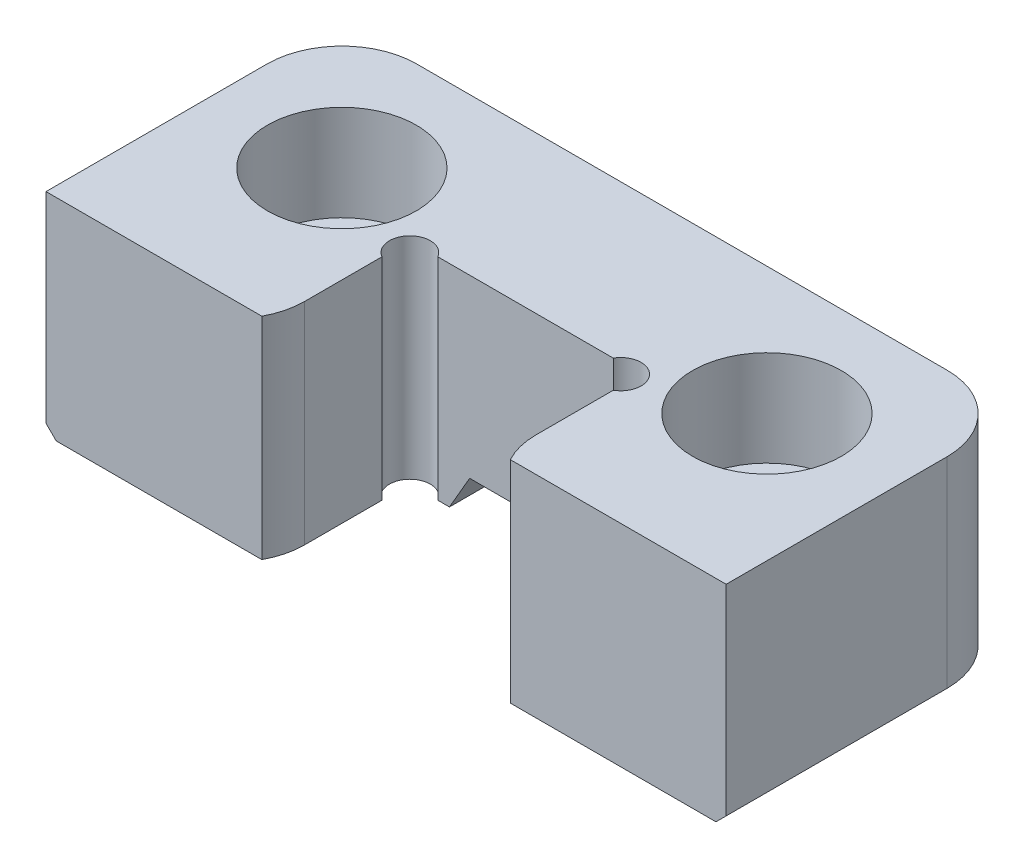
from build123d import *

# Parameters (mm, degrees)
BOSS_EXTRUDE1_DEPTH     = 15.748
FILLET1_R               = 5.588
CUT_EXTRUDE1_DEPTH      = 38.16828094
SKETCH3_R               = 1.524
CUT_EXTRUDE2_DEPTH      = 38.16828094
CUT_EXTRUDE3_DEPTH      = 38.16828094
CHAMFER1_SIZE           = 0.762
CHAMFER5_SIZE           = 3.81
CHAMFER5_SIZE2          = 1.020886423
F_1_4_CBORE_D           = 6.5278
F_1_4_CBORE_CBORE_D     = 11.1125
F_1_4_CBORE_CBORE_DEPTH = 7.14375


with BuildPart() as part:
    # Sketch1 → Boss-Extrude1 (new body)
    with BuildSketch(Plane(origin=(0, 0, 0), x_dir=(1, 0, 0), z_dir=(0, 1, 0))):
        Polygon((8.636, 0), (25.4, 0), (25.4, 22.098), (-25.4, 22.098), (-25.4, 0), (-8.636, 0), (-8.636, 10.414), (8.636, 10.414), align=None)
    extrude(amount=-BOSS_EXTRUDE1_DEPTH)

    # Fillet1
    fillet1_edges = [part.edges().sort_by_distance(p)[0] for p in [
        (-25.4, -7.874, -22.098),
        (25.4, -7.874, -22.098),
    ]]
    fillet(fillet1_edges, radius=FILLET1_R)

    # Sketch2 → Cut-Extrude1 (cut, through all)
    with BuildSketch(Plane(origin=(0, 0, 0), x_dir=(1, 0, 0), z_dir=(0, 1, 0))):
        with BuildLine():
            Line((-8.636, 2.54), (-8.636, 3.457932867))
            Line((-8.636, 3.457932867), (8.636, 3.457932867))
            Line((8.636, 3.457932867), (8.636, 2.54))
            ThreePointArc((8.636, 2.54), (8.800016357, 1.229575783), (9.281946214, 0))
            Line((9.281946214, 0), (28.575, 0))
            Line((28.575, 0), (28.575, -12.7))
            Line((28.575, -12.7), (-28.575, -12.7))
            Line((-28.575, -12.7), (-28.575, 0))
            Line((-28.575, 0), (-9.281946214, 0))
            ThreePointArc((-9.281946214, 0), (-8.800016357, 1.229575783), (-8.636, 2.54))
        make_face()
    extrude(amount=-CUT_EXTRUDE1_DEPTH, mode=Mode.SUBTRACT)

    # Sketch3 → Cut-Extrude2 (cut, through all)
    with BuildSketch(Plane(origin=(0, 0, 0), x_dir=(1, 0, 0), z_dir=(0, 1, 0))):
        with Locations((-7.874, 9.652)):
            Circle(SKETCH3_R)
        with Locations((7.874, 9.652)):
            Circle(SKETCH3_R)
    extrude(amount=-CUT_EXTRUDE2_DEPTH, mode=Mode.SUBTRACT)

    # Sketch5 → Cut-Extrude3 (cut, through all)
    with BuildSketch(Plane(origin=(0, 0, -22.098), x_dir=(-1, 0, 0), z_dir=(0, 0, -1))):
        Polygon((-4.7625, -14.1605), (4.7625, -14.1605), (5.679043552, -15.748), (-5.679043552, -15.748), align=None)
    extrude(amount=-CUT_EXTRUDE3_DEPTH, mode=Mode.SUBTRACT)

    # Chamfer1
    chamfer1_edges = [part.edges().sort_by_distance(p)[0] for p in [
        (25.4, -15.748, -8.255),
        (12.745521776, -15.748, -22.098),
        (-25.4, -15.748, -8.255),
        (-23.763312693, -15.748, -20.461312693),
        (23.763312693, -15.748, -20.461312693),
        (-12.745521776, -15.748, -22.098),
    ]]
    chamfer(chamfer1_edges, length=CHAMFER1_SIZE)

    # Chamfer5
    chamfer5_edges = [part.edges().sort_by_distance(p)[0] for p in [
        (0, -14.1605, -10.414),
    ]]
    chamfer5_side = [part.faces().sort_by_distance(p)[0] for p in [
        (0, -14.1605, -16.256),
    ]]
    chamfer(chamfer5_edges, length=CHAMFER5_SIZE, length2=CHAMFER5_SIZE2, reference=chamfer5_side[0])

    # 1_4_ CBORE (through all)
    with Locations(Plane(origin=(9.083120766, 0, -5.226040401), x_dir=(-1, 0, 0), z_dir=(0, 1, 0))):
        with Locations((24.958120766, -7.346959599), (-6.791879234, -7.346959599)):
            CounterBoreHole(F_1_4_CBORE_D / 2, F_1_4_CBORE_CBORE_D / 2, F_1_4_CBORE_CBORE_DEPTH)


solid = part.part
